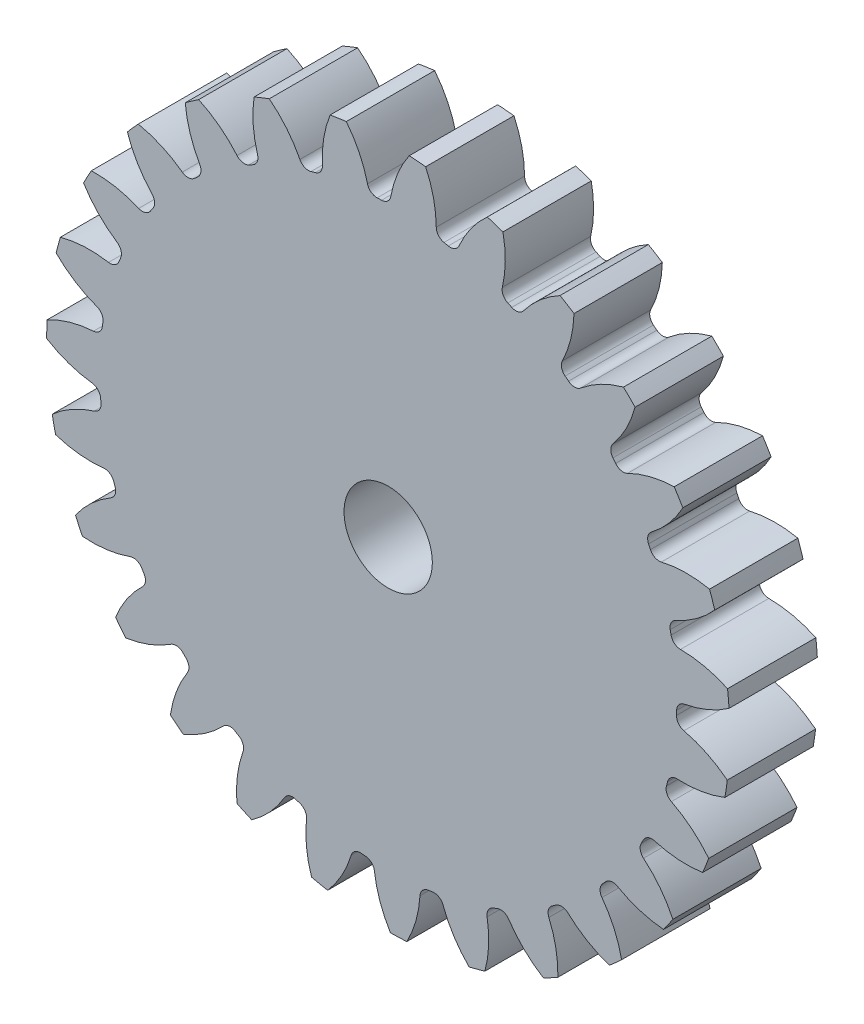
from build123d import *

# Parameters (mm, degrees)
SKETCH3_R         = 491.066666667
GEARBODY_DEPTH    = 127
TOOTHCUT_DEPTH    = 706.990043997
CIRPATTERN1_COUNT = 27
BOREDIA_R         = 63.5
BORE_DEPTH        = 12700


with BuildPart() as part:
    # Sketch3 → gearBody (new body)
    with BuildSketch(Plane.XY):
        Circle(SKETCH3_R)
    extrude(amount=GEARBODY_DEPTH)

    # Sketch2 → toothCut (cut, through all)
    with BuildSketch(Plane.XY):
        with BuildLine():
            ThreePointArc((414.608287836, -14.639630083), (414.70783614, -11.478752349), (414.783286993, -8.317207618))
            ThreePointArc((414.783286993, -8.317207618), (418.066213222, 0.338563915), (426.084522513, 4.965301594))
            ThreePointArc((426.084522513, 4.965301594), (460.089980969, 15.134968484), (491.066666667, 32.462353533))
            ThreePointArc((491.066666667, 32.462353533), (491.950058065, -13.616749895), (488.519112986, -59.576436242))
            ThreePointArc((488.519112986, -59.576436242), (458.548335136, -40.56207839), (425.157486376, -28.526940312))
            ThreePointArc((425.157486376, -28.526940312), (417.407385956, -23.463746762), (414.608287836, -14.639630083))
        make_face()
    toothcut = extrude(amount=TOOTHCUT_DEPTH, mode=Mode.SUBTRACT)

    # CirPattern1: toothCut ×27 about axis
    cirpattern1_axis = Axis((0, 0, 0), (0, 0, 1))
    for i in range(1, CIRPATTERN1_COUNT):
        add(toothcut.rotate(cirpattern1_axis, i * 360 / CIRPATTERN1_COUNT), mode=Mode.SUBTRACT)

    # boreDia → bore (cut, symmetric)
    with BuildSketch(Plane.XY):
        Circle(BOREDIA_R)
    extrude(amount=BORE_DEPTH, both=True, mode=Mode.SUBTRACT)


solid = part.part
